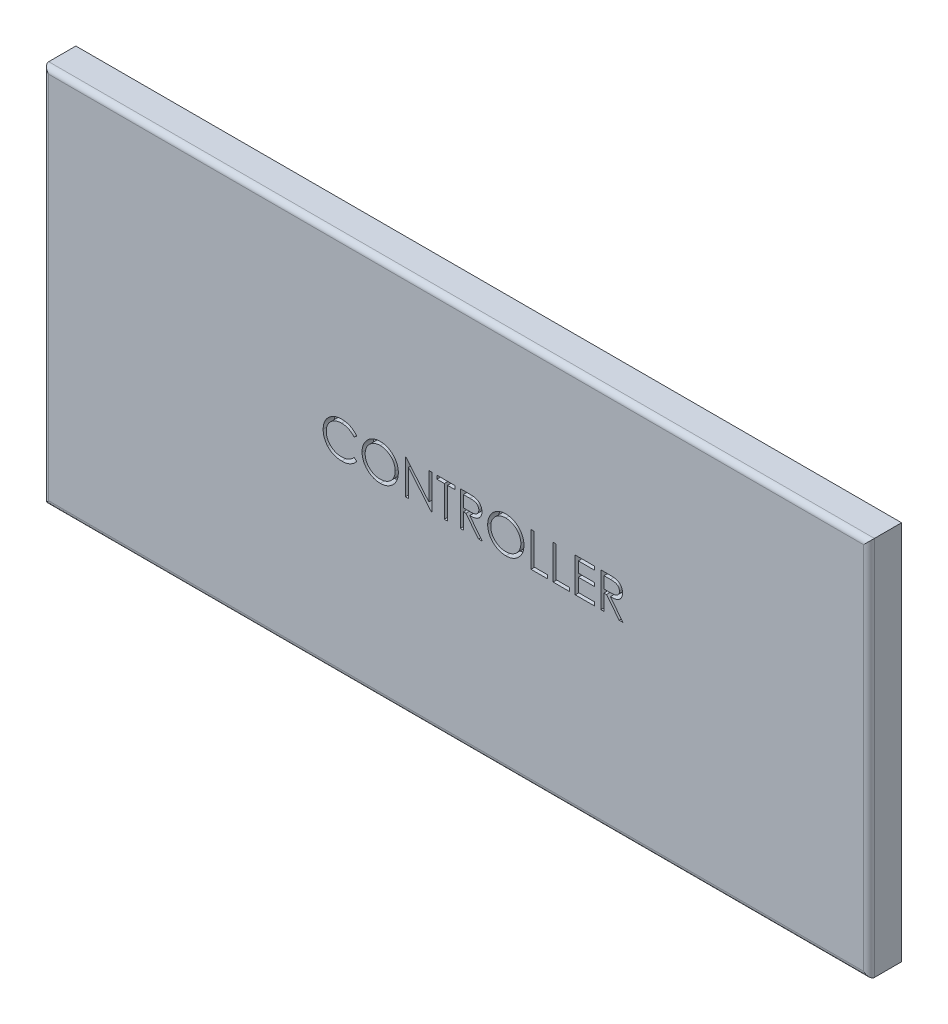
from build123d import *

# Parameters (mm, degrees)
SKETCH1_W           = 76
SKETCH1_H           = 35
BOSS_EXTRUDE1_DEPTH = 3
CUT_EXTRUDE1_DEPTH  = 1
FILLET1_R           = 0.5


with BuildPart() as part:
    # Sketch1 → Boss-Extrude1 (new body)
    with BuildSketch(Plane.XY):
        with Locations((-6.386554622, 2.138655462)):
            Rectangle(SKETCH1_W, SKETCH1_H)
    extrude(amount=BOSS_EXTRUDE1_DEPTH)

    # Sketch2 → Cut-Extrude1 (cut)
    # profile 1 of 10: a face of its own
    with BuildSketch(Plane.XY.offset(3)):
        with BuildLine():
            Line((-15.530587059, 4.464682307), (-15.77990597, 4.273877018))
            add(Edge.make_bspline(
                [(-15.77990597, 4.273877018), (-15.797691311, 4.295073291), (-15.833022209, 4.337180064), (-15.889863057, 4.396307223), (-15.949100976, 4.451702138), (-16.010713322, 4.503628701), (-16.075809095, 4.550271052), (-16.142811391, 4.594059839), (-16.212841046, 4.633309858), (-16.309680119, 4.680901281), (-16.436360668, 4.730563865), (-16.5958317, 4.772204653), (-16.762302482, 4.798712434), (-16.875874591, 4.801583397), (-16.933641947, 4.803043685)],
                knots=[0, 0, 0, 0, 0.757959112, 1.505699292, 2.245454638, 2.979532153, 3.711538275, 4.438200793, 5.171680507, 5.909471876, 7.393775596, 8.890124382, 10.418191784, 12, 12, 12, 12], degree=3))
            add(Edge.make_bspline(
                [(-16.933641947, 4.803043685), (-16.965467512, 4.802677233), (-17.028823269, 4.801947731), (-17.122847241, 4.792323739), (-17.215115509, 4.778797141), (-17.305568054, 4.758726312), (-17.394089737, 4.73335115), (-17.481259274, 4.703029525), (-17.565814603, 4.665514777), (-17.648925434, 4.624050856), (-17.728553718, 4.577217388), (-17.803896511, 4.526133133), (-17.874679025, 4.471369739), (-17.940957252, 4.412721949), (-18.002798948, 4.350453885), (-18.059756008, 4.283901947), (-18.111631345, 4.213278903), (-18.159453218, 4.139516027), (-18.202281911, 4.062828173), (-18.238141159, 3.982931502), (-18.269895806, 3.901194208), (-18.295022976, 3.816692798), (-18.314911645, 3.730021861), (-18.328634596, 3.640948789), (-18.338149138, 3.549659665), (-18.338875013, 3.487784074), (-18.339240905, 3.456594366)],
                knots=[0, 0, 0, 0, 1.054917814, 2.100044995, 3.131103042, 4.146048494, 5.169673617, 6.183595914, 7.203665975, 8.234915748, 9.262203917, 10.264457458, 11.251630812, 12.227803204, 13.197192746, 14.159520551, 15.12972552, 16.100847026, 17.073214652, 18.039054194, 19.002613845, 19.979014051, 20.95965708, 21.949030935, 22.966165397, 24, 24, 24, 24], degree=3))
            add(Edge.make_bspline(
                [(-18.339240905, 3.456594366), (-18.338096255, 3.409666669), (-18.335848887, 3.317530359), (-18.315847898, 3.182574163), (-18.285453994, 3.053287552), (-18.239901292, 2.930478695), (-18.183731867, 2.812633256), (-18.112756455, 2.701745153), (-18.030554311, 2.596138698), (-17.935962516, 2.498309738), (-17.832180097, 2.408943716), (-17.720830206, 2.330248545), (-17.602190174, 2.264648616), (-17.477569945, 2.210060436), (-17.346010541, 2.168098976), (-17.207748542, 2.138558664), (-17.063084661, 2.119288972), (-16.964233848, 2.117444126), (-16.913925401, 2.116505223)],
                knots=[0, 0, 0, 0, 1.029171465, 2.020641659, 2.987623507, 3.938342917, 4.889210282, 5.84687017, 6.821220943, 7.821438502, 8.827599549, 9.822697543, 10.807740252, 11.797342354, 12.80366471, 13.83203677, 14.896651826, 16, 16, 16, 16], degree=3))
            add(Edge.make_bspline(
                [(-16.913925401, 2.116505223), (-16.858496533, 2.118037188), (-16.749399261, 2.12105246), (-16.589408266, 2.146596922), (-16.436250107, 2.188015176), (-16.289916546, 2.24597972), (-16.150820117, 2.321331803), (-16.018743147, 2.412679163), (-15.893574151, 2.520890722), (-15.818307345, 2.603516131), (-15.77990597, 2.64567189)],
                knots=[0, 0, 0, 0, 1.028121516, 2.023589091, 2.998037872, 3.967518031, 4.937445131, 5.927275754, 6.942489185, 8, 8, 8, 8], degree=3))
            Line((-15.77990597, 2.64567189), (-15.530587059, 2.456774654))
            add(Edge.make_bspline(
                [(-15.530587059, 2.456774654), (-15.550651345, 2.430886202), (-15.590683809, 2.3792333), (-15.655506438, 2.306415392), (-15.723793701, 2.237922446), (-15.796052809, 2.174306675), (-15.87145252, 2.114295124), (-15.951346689, 2.059592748), (-16.034685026, 2.009436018), (-16.12118516, 1.963510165), (-16.210755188, 1.922763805), (-16.303287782, 1.887880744), (-16.39838409, 1.857831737), (-16.496048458, 1.833110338), (-16.596483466, 1.813814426), (-16.699326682, 1.800915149), (-16.804800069, 1.792077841), (-16.875957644, 1.791272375), (-16.912017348, 1.790864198)],
                knots=[0, 0, 0, 0, 0.986787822, 1.968848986, 2.935600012, 3.899624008, 4.868462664, 5.837806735, 6.815139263, 7.798259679, 8.787526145, 9.778297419, 10.776456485, 11.791383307, 12.812564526, 13.85620153, 14.913611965, 16, 16, 16, 16], degree=3))
            add(Edge.make_bspline(
                [(-16.912017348, 1.790864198), (-16.946165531, 1.791101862), (-17.013689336, 1.791571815), (-17.113383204, 1.79918471), (-17.210438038, 1.809571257), (-17.304576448, 1.825210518), (-17.396312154, 1.843665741), (-17.484813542, 1.868404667), (-17.570951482, 1.896117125), (-17.654379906, 1.928688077), (-17.735169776, 1.965442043), (-17.813060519, 2.006981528), (-17.888016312, 2.05295722), (-17.960774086, 2.102355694), (-18.030259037, 2.156763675), (-18.097073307, 2.21542555), (-18.161591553, 2.278143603), (-18.201508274, 2.323369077), (-18.221577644, 2.346107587)],
                knots=[0, 0, 0, 0, 1.114604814, 2.203992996, 3.262667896, 4.300477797, 5.318619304, 6.316056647, 7.298880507, 8.271930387, 9.238335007, 10.195173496, 11.151986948, 12.108099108, 13.064862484, 14.031167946, 15.010108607, 16, 16, 16, 16], degree=3))
            add(Edge.make_bspline(
                [(-18.221577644, 2.346107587), (-18.253722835, 2.385605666), (-18.317625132, 2.464124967), (-18.399382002, 2.591384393), (-18.469365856, 2.724251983), (-18.525949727, 2.863425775), (-18.570184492, 3.008593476), (-18.600828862, 3.159828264), (-18.620742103, 3.316988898), (-18.623019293, 3.423883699), (-18.624176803, 3.478218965)],
                knots=[0, 0, 0, 0, 0.994628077, 1.977248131, 2.950237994, 3.925870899, 4.908910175, 5.911660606, 6.938484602, 8, 8, 8, 8], degree=3))
            add(Edge.make_bspline(
                [(-18.624176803, 3.478218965), (-18.62276602, 3.535328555), (-18.619990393, 3.647688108), (-18.596408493, 3.812583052), (-18.558472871, 3.970563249), (-18.504591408, 4.121333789), (-18.436278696, 4.265687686), (-18.351890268, 4.402522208), (-18.252406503, 4.532712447), (-18.138607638, 4.654282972), (-18.013814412, 4.76544367), (-17.880175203, 4.863239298), (-17.737951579, 4.944625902), (-17.588710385, 5.012658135), (-17.431334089, 5.064949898), (-17.266158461, 5.101556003), (-17.093493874, 5.124340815), (-16.975690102, 5.127221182), (-16.915833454, 5.128684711)],
                knots=[0, 0, 0, 0, 1.032925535, 2.032216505, 3.007276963, 3.968222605, 4.92396291, 5.891752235, 6.871517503, 7.883894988, 8.900124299, 9.891468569, 10.874487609, 11.85992873, 12.854644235, 13.869047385, 14.917252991, 16, 16, 16, 16], degree=3))
            add(Edge.make_bspline(
                [(-16.915833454, 5.128684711), (-16.879353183, 5.128247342), (-16.80714416, 5.127381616), (-16.700325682, 5.118939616), (-16.596328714, 5.104866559), (-16.495081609, 5.085711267), (-16.396091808, 5.061937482), (-16.300115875, 5.030967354), (-16.206590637, 4.995555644), (-16.116105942, 4.954771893), (-16.029095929, 4.908991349), (-15.945587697, 4.858721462), (-15.866244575, 4.804024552), (-15.790508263, 4.745365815), (-15.7196457, 4.681504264), (-15.65164493, 4.614196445), (-15.588815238, 4.541503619), (-15.550031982, 4.490336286), (-15.530587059, 4.464682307)],
                knots=[0, 0, 0, 0, 1.096760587, 2.17092713, 3.219439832, 4.250915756, 5.268269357, 6.278326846, 7.281116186, 8.274029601, 9.260640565, 10.235837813, 11.203064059, 12.156899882, 13.114053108, 14.069676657, 15.032185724, 16, 16, 16, 16], degree=3))
        make_face()
    # profile 2 of 10: a face of its own
    with BuildSketch(Plane.XY.offset(3)):
        with BuildLine():
            add(Edge.make_bspline(
                [(-13.393567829, 5.128684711), (-13.334777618, 5.127195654), (-13.219308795, 5.124271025), (-13.049605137, 5.101883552), (-12.887593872, 5.063152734), (-12.731955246, 5.011569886), (-12.584550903, 4.942759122), (-12.444271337, 4.859587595), (-12.311450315, 4.76118395), (-12.187878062, 4.648308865), (-12.0747964, 4.525496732), (-11.975168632, 4.394434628), (-11.891673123, 4.255915), (-11.823106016, 4.110354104), (-11.769313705, 3.958081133), (-11.732194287, 3.798284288), (-11.708483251, 3.631998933), (-11.705711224, 3.518581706), (-11.704305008, 3.461046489)],
                knots=[0, 0, 0, 0, 1.065120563, 2.091984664, 3.0946048, 4.079830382, 5.057816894, 6.036188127, 7.030412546, 8.04752943, 9.064399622, 10.05169764, 11.02544977, 11.989514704, 12.962713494, 13.945757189, 14.957906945, 16, 16, 16, 16], degree=3))
            add(Edge.make_bspline(
                [(-11.704305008, 3.461046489), (-11.705711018, 3.403935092), (-11.708482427, 3.29136191), (-11.732221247, 3.126131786), (-11.769451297, 2.967299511), (-11.822606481, 2.81513024), (-11.890846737, 2.66946345), (-11.974898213, 2.530682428), (-12.073904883, 2.398741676), (-12.186578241, 2.275086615), (-12.309406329, 2.161696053), (-12.441150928, 2.062891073), (-12.578849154, 1.977869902), (-12.724272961, 1.910030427), (-12.875493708, 1.855808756), (-13.033864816, 1.818840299), (-13.19864419, 1.794994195), (-13.311012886, 1.79225597), (-13.368127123, 1.790864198)],
                knots=[0, 0, 0, 0, 1.043624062, 2.057103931, 3.04512605, 4.022047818, 4.998200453, 5.980619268, 6.982898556, 8.009068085, 9.034988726, 10.034168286, 11.015286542, 11.987931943, 12.962482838, 13.94673481, 14.956375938, 16, 16, 16, 16], degree=3))
            add(Edge.make_bspline(
                [(-13.368127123, 1.790864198), (-13.425662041, 1.792269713), (-13.53907868, 1.795040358), (-13.705572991, 1.818790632), (-13.865482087, 1.855930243), (-14.018348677, 1.90900666), (-14.164258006, 1.977602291), (-14.303495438, 2.061244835), (-14.435502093, 2.160492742), (-14.559183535, 2.273129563), (-14.672348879, 2.395749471), (-14.771009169, 2.527134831), (-14.854670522, 2.664707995), (-14.923035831, 2.808850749), (-14.977160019, 2.958866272), (-15.014085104, 3.115755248), (-15.037975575, 3.278623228), (-15.040728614, 3.389515), (-15.042125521, 3.445782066)],
                knots=[0, 0, 0, 0, 1.053102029, 2.075944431, 3.073151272, 4.055350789, 5.033113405, 6.020478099, 7.024410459, 8.052272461, 9.079885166, 10.07527673, 11.055994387, 12.023226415, 12.992069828, 13.970394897, 14.97016774, 16, 16, 16, 16], degree=3))
            add(Edge.make_bspline(
                [(-15.042125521, 3.445782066), (-15.04164053, 3.483548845), (-15.040676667, 3.558605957), (-15.029072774, 3.670063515), (-15.01223466, 3.779728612), (-14.988102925, 3.887289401), (-14.956541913, 3.99248258), (-14.919301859, 4.096033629), (-14.873817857, 4.19689315), (-14.822400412, 4.295538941), (-14.765012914, 4.390433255), (-14.701625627, 4.480131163), (-14.634464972, 4.565385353), (-14.560838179, 4.643986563), (-14.483171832, 4.71822138), (-14.400206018, 4.786948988), (-14.312446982, 4.850789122), (-14.219517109, 4.908320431), (-14.123706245, 4.960353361), (-14.024939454, 5.005004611), (-13.924558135, 5.043327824), (-13.822092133, 5.074389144), (-13.717813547, 5.098911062), (-13.611494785, 5.115609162), (-13.503220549, 5.12724265), (-13.430275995, 5.128201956), (-13.393567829, 5.128684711)],
                knots=[0, 0, 0, 0, 1.037015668, 2.060948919, 3.074880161, 4.083647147, 5.086022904, 6.090072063, 7.104153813, 8.122640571, 9.144368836, 10.147691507, 11.138137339, 12.123020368, 13.103399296, 14.087645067, 15.080126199, 16.082011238, 17.087798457, 18.072939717, 19.057185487, 20.037253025, 21.01195951, 21.997135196, 22.992090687, 24, 24, 24, 24], degree=3))
        make_face()
        with BuildLine():
            add(Edge.make_bspline(
                [(-13.379575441, 4.803043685), (-13.409705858, 4.802676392), (-13.469678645, 4.801945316), (-13.55883676, 4.792315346), (-13.6468223, 4.778590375), (-13.733653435, 4.759012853), (-13.818966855, 4.732339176), (-13.903557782, 4.701640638), (-13.986654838, 4.66424722), (-14.067983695, 4.621999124), (-14.146828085, 4.575236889), (-14.221225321, 4.523555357), (-14.291368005, 4.468166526), (-14.357084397, 4.408941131), (-14.418181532, 4.345577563), (-14.47586194, 4.279036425), (-14.527813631, 4.207415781), (-14.575425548, 4.132657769), (-14.618032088, 4.054859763), (-14.655919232, 3.974840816), (-14.686910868, 3.891948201), (-14.712186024, 3.807081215), (-14.733140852, 3.720374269), (-14.746415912, 3.631169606), (-14.756151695, 3.539915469), (-14.756840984, 3.478246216), (-14.757189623, 3.447054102)],
                knots=[0, 0, 0, 0, 1.008559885, 2.007477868, 2.99961109, 3.989939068, 4.984837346, 5.991145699, 7.001802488, 8.033829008, 9.059044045, 10.069351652, 11.065060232, 12.050310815, 13.029377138, 14.011219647, 14.996725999, 15.989392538, 16.977580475, 17.965360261, 18.951710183, 19.937753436, 20.929683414, 21.935841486, 22.955955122, 24, 24, 24, 24], degree=3))
            add(Edge.make_bspline(
                [(-14.757189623, 3.447054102), (-14.756033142, 3.401186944), (-14.753757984, 3.310952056), (-14.733839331, 3.178719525), (-14.703157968, 3.051639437), (-14.657930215, 2.930407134), (-14.6013693, 2.813980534), (-14.531494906, 2.703392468), (-14.448709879, 2.598613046), (-14.354672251, 2.500373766), (-14.251872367, 2.410706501), (-14.142713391, 2.331999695), (-14.028364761, 2.265406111), (-13.908528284, 2.211154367), (-13.783843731, 2.168165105), (-13.653507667, 2.138702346), (-13.518388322, 2.119311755), (-13.426285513, 2.117449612), (-13.379575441, 2.116505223)],
                knots=[0, 0, 0, 0, 1.032063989, 2.030389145, 3.003944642, 3.970395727, 4.937377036, 5.913328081, 6.909231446, 7.93887556, 8.970685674, 9.976071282, 10.964166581, 11.944589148, 12.933237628, 13.927779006, 14.949070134, 16, 16, 16, 16], degree=3))
            add(Edge.make_bspline(
                [(-13.379575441, 2.116505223), (-13.348179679, 2.116936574), (-13.285912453, 2.117792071), (-13.193297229, 2.126408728), (-13.102350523, 2.140226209), (-13.013199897, 2.160120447), (-12.925946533, 2.185018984), (-12.840226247, 2.214598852), (-12.756952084, 2.251502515), (-12.675073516, 2.292276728), (-12.596699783, 2.338758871), (-12.521882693, 2.388686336), (-12.452508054, 2.443993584), (-12.386840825, 2.502339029), (-12.32549285, 2.564899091), (-12.268878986, 2.631592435), (-12.217189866, 2.702840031), (-12.169596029, 2.777484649), (-12.127138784, 2.855495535), (-12.090146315, 2.9358046), (-12.058762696, 3.018214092), (-12.033427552, 3.102842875), (-12.013574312, 3.189530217), (-11.99989467, 3.278392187), (-11.99032573, 3.36925102), (-11.989604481, 3.430704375), (-11.989240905, 3.461682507)],
                knots=[0, 0, 0, 0, 1.047197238, 2.076906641, 3.100256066, 4.114471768, 5.12198147, 6.126382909, 7.136867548, 8.15857795, 9.17633901, 10.174870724, 11.156907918, 12.133735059, 13.104061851, 14.077631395, 15.04955518, 16.038496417, 17.029181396, 18.010275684, 18.986308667, 19.968651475, 20.955262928, 21.950658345, 22.966943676, 24, 24, 24, 24], degree=3))
            add(Edge.make_bspline(
                [(-11.989240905, 3.461682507), (-11.989604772, 3.492448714), (-11.990326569, 3.553479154), (-11.9998901, 3.643704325), (-12.013588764, 3.731926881), (-12.03333065, 3.817800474), (-12.058776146, 3.901346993), (-12.090151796, 3.982487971), (-12.127149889, 4.061525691), (-12.169611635, 4.138264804), (-12.217341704, 4.211901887), (-12.269497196, 4.282298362), (-12.326978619, 4.348132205), (-12.388143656, 4.411028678), (-12.454520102, 4.469646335), (-12.525807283, 4.524004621), (-12.601139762, 4.575415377), (-12.680902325, 4.621793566), (-12.763220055, 4.66462362), (-12.847687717, 4.701318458), (-12.9333484, 4.732498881), (-13.019984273, 4.759093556), (-13.108324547, 4.778513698), (-13.197772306, 4.792327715), (-13.288203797, 4.801941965), (-13.349021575, 4.802675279), (-13.379575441, 4.803043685)],
                knots=[0, 0, 0, 0, 1.02996197, 2.043119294, 3.035359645, 4.018872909, 4.991431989, 5.957985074, 6.929999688, 7.912076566, 8.892894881, 9.867085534, 10.843653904, 11.817741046, 12.803660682, 13.806313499, 14.818574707, 15.856120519, 16.894564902, 17.924820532, 18.937903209, 19.946497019, 20.957711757, 21.963978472, 22.977135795, 24, 24, 24, 24], degree=3))
        make_face(mode=Mode.SUBTRACT)
    # profile 3 of 10: a face of its own
    with BuildSketch(Plane.XY.offset(3)):
        Polygon((-11.053022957, 1.872274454), (-11.053022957, 5.047274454), (-10.9932373, 5.047274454), (-8.895651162, 2.548361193), (-8.895651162, 5.047274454), (-8.610715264, 5.047274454), (-8.610715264, 1.872274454), (-8.675589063, 1.872274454), (-10.768087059, 4.365463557), (-10.768087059, 1.872274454), align=None)
    # profile 4 of 10: a face of its own
    with BuildSketch(Plane.XY.offset(3)):
        Polygon((-8.162958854, 4.721633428), (-8.162958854, 5.047274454), (-6.494048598, 5.047274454), (-6.494048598, 4.721633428), (-7.186035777, 4.721633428), (-7.186035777, 1.872274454), (-7.470971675, 1.872274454), (-7.470971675, 4.721633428), align=None)
    # profile 5 of 10: a face of its own
    with BuildSketch(Plane.XY.offset(3)):
        with BuildLine():
            Line((-6.005587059, 5.047274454), (-5.370205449, 5.047274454))
            add(Edge.make_bspline(
                [(-5.370205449, 5.047274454), (-5.327804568, 5.047133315), (-5.24639018, 5.046862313), (-5.129755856, 5.045351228), (-5.023776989, 5.041020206), (-4.928508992, 5.037293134), (-4.843953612, 5.030496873), (-4.76985157, 5.024001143), (-4.706544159, 5.015497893), (-4.668221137, 5.007600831), (-4.650869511, 5.004025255)],
                knots=[0, 0, 0, 0, 1.410062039, 2.707475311, 3.878576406, 4.937260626, 5.877586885, 6.699081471, 7.410979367, 8, 8, 8, 8], degree=3))
            add(Edge.make_bspline(
                [(-4.650869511, 5.004025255), (-4.627640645, 4.998285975), (-4.581678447, 4.98692985), (-4.515502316, 4.962927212), (-4.452442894, 4.935150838), (-4.392762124, 4.902526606), (-4.336758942, 4.864812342), (-4.283855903, 4.822659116), (-4.233812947, 4.77629758), (-4.188653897, 4.724558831), (-4.146073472, 4.670278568), (-4.110160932, 4.611583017), (-4.07920334, 4.550204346), (-4.054555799, 4.485518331), (-4.034709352, 4.418152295), (-4.020715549, 4.34749603), (-4.0123234, 4.273871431), (-4.011469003, 4.223653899), (-4.011035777, 4.19819092)],
                knots=[0, 0, 0, 0, 1.027469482, 2.033020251, 3.019912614, 3.986113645, 4.951240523, 5.91722682, 6.890402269, 7.87763091, 8.8651537, 9.85103654, 10.82876324, 11.815024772, 12.821070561, 13.842952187, 14.906261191, 16, 16, 16, 16], degree=3))
            add(Edge.make_bspline(
                [(-4.011035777, 4.19819092), (-4.012368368, 4.155886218), (-4.014968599, 4.073338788), (-4.039212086, 3.953540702), (-4.078923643, 3.841790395), (-4.133645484, 3.738228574), (-4.203331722, 3.644873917), (-4.287083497, 3.562876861), (-4.38494753, 3.494260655), (-4.476051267, 3.446678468), (-4.55652772, 3.4162049), (-4.622779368, 3.394763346), (-4.695048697, 3.378197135), (-4.772643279, 3.363356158), (-4.855886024, 3.352151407), (-4.944577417, 3.343944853), (-5.038780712, 3.338815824), (-5.103495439, 3.338052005), (-5.136786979, 3.337659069)],
                knots=[0, 0, 0, 0, 1.260483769, 2.459530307, 3.627416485, 4.787058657, 5.939039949, 7.08810263, 8.267026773, 9.491475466, 10.141966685, 10.831826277, 11.566392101, 12.351337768, 13.187381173, 14.07005841, 15.007169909, 16, 16, 16, 16], degree=3))
            Line((-5.136786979, 3.337659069), (-3.970330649, 1.872274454))
            Line((-3.970330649, 1.872274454), (-4.322684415, 1.872274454))
            Line((-4.322684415, 1.872274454), (-5.489140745, 3.337659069))
            Line((-5.489140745, 3.337659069), (-5.720651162, 3.337659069))
            Line((-5.720651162, 3.337659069), (-5.720651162, 1.872274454))
            Line((-5.720651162, 1.872274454), (-6.005587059, 1.872274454))
            Line((-6.005587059, 1.872274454), (-6.005587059, 5.047274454))
        make_face()
        with BuildLine():
            Line((-5.720651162, 4.721633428), (-5.720651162, 3.663300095))
            Line((-5.720651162, 3.663300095), (-5.13933105, 3.658847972))
            add(Edge.make_bspline(
                [(-5.13933105, 3.658847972), (-5.1121893, 3.658835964), (-5.059580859, 3.65881269), (-4.98347097, 3.662435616), (-4.912604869, 3.666557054), (-4.847253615, 3.672861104), (-4.787388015, 3.68098554), (-4.73303799, 3.691148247), (-4.684114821, 3.702988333), (-4.627056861, 3.721314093), (-4.563342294, 3.750348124), (-4.494098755, 3.792589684), (-4.435132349, 3.845720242), (-4.385314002, 3.906474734), (-4.345282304, 3.973273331), (-4.317059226, 4.045315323), (-4.29915001, 4.120781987), (-4.297037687, 4.172650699), (-4.295971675, 4.198826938)],
                knots=[0, 0, 0, 0, 1.146690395, 2.22261258, 3.21895312, 4.145990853, 4.996080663, 5.770904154, 6.481378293, 7.121626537, 8.300444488, 9.431385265, 10.535395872, 11.636531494, 12.74115979, 13.810798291, 14.895190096, 16, 16, 16, 16], degree=3))
            add(Edge.make_bspline(
                [(-4.295971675, 4.198826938), (-4.29706217, 4.224359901), (-4.299223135, 4.274956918), (-4.316865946, 4.349030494), (-4.346701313, 4.418941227), (-4.386907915, 4.484404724), (-4.435892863, 4.543827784), (-4.493331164, 4.594670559), (-4.557652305, 4.636625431), (-4.61776975, 4.663435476), (-4.671503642, 4.679872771), (-4.718157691, 4.691439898), (-4.770873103, 4.700733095), (-4.829905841, 4.708178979), (-4.895003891, 4.714578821), (-4.966496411, 4.718889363), (-5.043909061, 4.72144194), (-5.097563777, 4.721568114), (-5.125338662, 4.721633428)],
                knots=[0, 0, 0, 0, 1.101028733, 2.181837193, 3.264309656, 4.369019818, 5.486613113, 6.575447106, 7.666700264, 8.788928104, 9.402425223, 10.0903467, 10.862060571, 11.710948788, 12.657782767, 13.684531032, 14.801375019, 16, 16, 16, 16], degree=3))
            Line((-5.125338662, 4.721633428), (-5.720651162, 4.721633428))
        make_face(mode=Mode.SUBTRACT)
    # profile 6 of 10: a face of its own
    with BuildSketch(Plane.XY.offset(3)):
        with BuildLine():
            add(Edge.make_bspline(
                [(-1.833311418, 5.128684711), (-1.774521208, 5.127195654), (-1.659052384, 5.124271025), (-1.489348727, 5.101883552), (-1.327337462, 5.063152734), (-1.171698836, 5.011569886), (-1.024294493, 4.942759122), (-0.884014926, 4.859587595), (-0.751193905, 4.76118395), (-0.627621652, 4.648308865), (-0.51453999, 4.525496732), (-0.414912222, 4.394434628), (-0.331416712, 4.255915), (-0.262849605, 4.110354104), (-0.209057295, 3.958081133), (-0.171937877, 3.798284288), (-0.148226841, 3.631998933), (-0.145454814, 3.518581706), (-0.144048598, 3.461046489)],
                knots=[0, 0, 0, 0, 1.065120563, 2.091984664, 3.0946048, 4.079830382, 5.057816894, 6.036188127, 7.030412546, 8.04752943, 9.064399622, 10.05169764, 11.02544977, 11.989514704, 12.962713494, 13.945757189, 14.957906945, 16, 16, 16, 16], degree=3))
            add(Edge.make_bspline(
                [(-0.144048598, 3.461046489), (-0.145454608, 3.403935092), (-0.148226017, 3.29136191), (-0.171964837, 3.126131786), (-0.209194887, 2.967299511), (-0.262350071, 2.81513024), (-0.330590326, 2.66946345), (-0.414641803, 2.530682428), (-0.513648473, 2.398741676), (-0.626321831, 2.275086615), (-0.749149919, 2.161696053), (-0.880894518, 2.062891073), (-1.018592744, 1.977869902), (-1.16401655, 1.910030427), (-1.315237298, 1.855808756), (-1.473608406, 1.818840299), (-1.63838778, 1.794994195), (-1.750756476, 1.79225597), (-1.807870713, 1.790864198)],
                knots=[0, 0, 0, 0, 1.043624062, 2.057103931, 3.04512605, 4.022047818, 4.998200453, 5.980619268, 6.982898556, 8.009068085, 9.034988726, 10.034168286, 11.015286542, 11.987931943, 12.962482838, 13.94673481, 14.956375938, 16, 16, 16, 16], degree=3))
            add(Edge.make_bspline(
                [(-1.807870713, 1.790864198), (-1.865405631, 1.792269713), (-1.97882227, 1.795040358), (-2.145316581, 1.818790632), (-2.305225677, 1.855930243), (-2.458092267, 1.90900666), (-2.604001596, 1.977602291), (-2.743239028, 2.061244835), (-2.875245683, 2.160492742), (-2.998927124, 2.273129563), (-3.112092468, 2.395749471), (-3.210752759, 2.527134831), (-3.294414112, 2.664707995), (-3.362779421, 2.808850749), (-3.416903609, 2.958866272), (-3.453828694, 3.115755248), (-3.477719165, 3.278623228), (-3.480472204, 3.389515), (-3.481869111, 3.445782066)],
                knots=[0, 0, 0, 0, 1.053102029, 2.075944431, 3.073151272, 4.055350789, 5.033113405, 6.020478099, 7.024410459, 8.052272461, 9.079885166, 10.07527673, 11.055994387, 12.023226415, 12.992069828, 13.970394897, 14.97016774, 16, 16, 16, 16], degree=3))
            add(Edge.make_bspline(
                [(-3.481869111, 3.445782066), (-3.48138412, 3.483548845), (-3.480420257, 3.558605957), (-3.468816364, 3.670063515), (-3.45197825, 3.779728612), (-3.427846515, 3.887289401), (-3.396285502, 3.99248258), (-3.359045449, 4.096033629), (-3.313561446, 4.19689315), (-3.262144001, 4.295538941), (-3.204756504, 4.390433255), (-3.141369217, 4.480131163), (-3.074208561, 4.565385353), (-3.000581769, 4.643986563), (-2.922915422, 4.71822138), (-2.839949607, 4.786948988), (-2.752190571, 4.850789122), (-2.659260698, 4.908320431), (-2.563449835, 4.960353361), (-2.464683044, 5.005004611), (-2.364301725, 5.043327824), (-2.261835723, 5.074389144), (-2.157557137, 5.098911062), (-2.051238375, 5.115609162), (-1.942964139, 5.12724265), (-1.870019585, 5.128201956), (-1.833311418, 5.128684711)],
                knots=[0, 0, 0, 0, 1.037015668, 2.060948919, 3.074880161, 4.083647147, 5.086022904, 6.090072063, 7.104153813, 8.122640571, 9.144368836, 10.147691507, 11.138137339, 12.123020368, 13.103399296, 14.087645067, 15.080126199, 16.082011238, 17.087798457, 18.072939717, 19.057185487, 20.037253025, 21.01195951, 21.997135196, 22.992090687, 24, 24, 24, 24], degree=3))
        make_face()
        with BuildLine():
            add(Edge.make_bspline(
                [(-1.81931903, 4.803043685), (-1.849449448, 4.802676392), (-1.909422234, 4.801945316), (-1.998580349, 4.792315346), (-2.086565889, 4.778590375), (-2.173397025, 4.759012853), (-2.258710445, 4.732339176), (-2.343301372, 4.701640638), (-2.426398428, 4.66424722), (-2.507727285, 4.621999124), (-2.586571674, 4.575236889), (-2.660968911, 4.523555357), (-2.731111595, 4.468166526), (-2.796827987, 4.408941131), (-2.857925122, 4.345577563), (-2.915605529, 4.279036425), (-2.967557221, 4.207415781), (-3.015169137, 4.132657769), (-3.057775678, 4.054859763), (-3.095662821, 3.974840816), (-3.126654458, 3.891948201), (-3.151929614, 3.807081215), (-3.172884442, 3.720374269), (-3.186159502, 3.631169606), (-3.195895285, 3.539915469), (-3.196584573, 3.478246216), (-3.196933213, 3.447054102)],
                knots=[0, 0, 0, 0, 1.008559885, 2.007477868, 2.99961109, 3.989939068, 4.984837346, 5.991145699, 7.001802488, 8.033829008, 9.059044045, 10.069351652, 11.065060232, 12.050310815, 13.029377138, 14.011219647, 14.996725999, 15.989392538, 16.977580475, 17.965360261, 18.951710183, 19.937753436, 20.929683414, 21.935841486, 22.955955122, 24, 24, 24, 24], degree=3))
            add(Edge.make_bspline(
                [(-3.196933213, 3.447054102), (-3.195776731, 3.401186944), (-3.193501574, 3.310952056), (-3.173582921, 3.178719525), (-3.142901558, 3.051639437), (-3.097673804, 2.930407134), (-3.04111289, 2.813980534), (-2.971238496, 2.703392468), (-2.888453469, 2.598613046), (-2.794415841, 2.500373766), (-2.691615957, 2.410706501), (-2.582456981, 2.331999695), (-2.468108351, 2.265406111), (-2.348271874, 2.211154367), (-2.223587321, 2.168165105), (-2.093251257, 2.138702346), (-1.958131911, 2.119311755), (-1.866029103, 2.117449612), (-1.81931903, 2.116505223)],
                knots=[0, 0, 0, 0, 1.032063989, 2.030389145, 3.003944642, 3.970395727, 4.937377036, 5.913328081, 6.909231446, 7.93887556, 8.970685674, 9.976071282, 10.964166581, 11.944589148, 12.933237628, 13.927779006, 14.949070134, 16, 16, 16, 16], degree=3))
            add(Edge.make_bspline(
                [(-1.81931903, 2.116505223), (-1.787923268, 2.116936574), (-1.725656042, 2.117792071), (-1.633040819, 2.126408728), (-1.542094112, 2.140226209), (-1.452943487, 2.160120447), (-1.365690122, 2.185018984), (-1.279969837, 2.214598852), (-1.196695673, 2.251502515), (-1.114817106, 2.292276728), (-1.036443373, 2.338758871), (-0.961626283, 2.388686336), (-0.892251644, 2.443993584), (-0.826584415, 2.502339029), (-0.76523644, 2.564899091), (-0.708622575, 2.631592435), (-0.656933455, 2.702840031), (-0.609339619, 2.777484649), (-0.566882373, 2.855495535), (-0.529889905, 2.9358046), (-0.498506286, 3.018214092), (-0.473171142, 3.102842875), (-0.453317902, 3.189530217), (-0.43963826, 3.278392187), (-0.430069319, 3.36925102), (-0.429348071, 3.430704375), (-0.428984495, 3.461682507)],
                knots=[0, 0, 0, 0, 1.047197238, 2.076906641, 3.100256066, 4.114471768, 5.12198147, 6.126382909, 7.136867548, 8.15857795, 9.17633901, 10.174870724, 11.156907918, 12.133735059, 13.104061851, 14.077631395, 15.04955518, 16.038496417, 17.029181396, 18.010275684, 18.986308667, 19.968651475, 20.955262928, 21.950658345, 22.966943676, 24, 24, 24, 24], degree=3))
            add(Edge.make_bspline(
                [(-0.428984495, 3.461682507), (-0.429348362, 3.492448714), (-0.430070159, 3.553479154), (-0.439633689, 3.643704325), (-0.453332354, 3.731926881), (-0.473074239, 3.817800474), (-0.498519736, 3.901346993), (-0.529895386, 3.982487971), (-0.566893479, 4.061525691), (-0.609355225, 4.138264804), (-0.657085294, 4.211901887), (-0.709240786, 4.282298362), (-0.766722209, 4.348132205), (-0.827887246, 4.411028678), (-0.894263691, 4.469646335), (-0.965550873, 4.524004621), (-1.040883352, 4.575415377), (-1.120645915, 4.621793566), (-1.202963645, 4.66462362), (-1.287431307, 4.701318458), (-1.37309199, 4.732498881), (-1.459727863, 4.759093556), (-1.548068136, 4.778513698), (-1.637515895, 4.792327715), (-1.727947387, 4.801941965), (-1.788765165, 4.802675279), (-1.81931903, 4.803043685)],
                knots=[0, 0, 0, 0, 1.02996197, 2.043119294, 3.035359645, 4.018872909, 4.991431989, 5.957985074, 6.929999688, 7.912076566, 8.892894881, 9.867085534, 10.843653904, 11.817741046, 12.803660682, 13.806313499, 14.818574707, 15.856120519, 16.894564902, 17.924820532, 18.937903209, 19.946497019, 20.957711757, 21.963978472, 22.977135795, 24, 24, 24, 24], degree=3))
        make_face(mode=Mode.SUBTRACT)
    # profile 7 of 10: a face of its own
    with BuildSketch(Plane.XY.offset(3)):
        Polygon((0.507233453, 5.047274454), (0.792169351, 5.047274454), (0.792169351, 2.19791548), (2.013323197, 2.19791548), (2.013323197, 1.872274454), (0.507233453, 1.872274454), align=None)
    # profile 8 of 10: a face of its own
    with BuildSketch(Plane.XY.offset(3)):
        Polygon((2.542489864, 5.047274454), (2.827425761, 5.047274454), (2.827425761, 2.19791548), (4.048579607, 2.19791548), (4.048579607, 1.872274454), (2.542489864, 1.872274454), align=None)
    # profile 9 of 10: a face of its own
    with BuildSketch(Plane.XY.offset(3)):
        Polygon((4.577746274, 5.047274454), (6.368771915, 5.047274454), (6.368771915, 4.721633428), (4.862682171, 4.721633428), (4.862682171, 3.744710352), (6.368771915, 3.744710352), (6.368771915, 3.419069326), (4.862682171, 3.419069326), (4.862682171, 2.19791548), (6.368771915, 2.19791548), (6.368771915, 1.872274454), (4.577746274, 1.872274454), align=None)
    # profile 10 of 10: a face of its own
    with BuildSketch(Plane.XY.offset(3)):
        with BuildLine():
            Line((6.93864371, 5.047274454), (7.57402532, 5.047274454))
            add(Edge.make_bspline(
                [(7.57402532, 5.047274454), (7.616426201, 5.047133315), (7.697840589, 5.046862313), (7.814474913, 5.045351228), (7.92045378, 5.041020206), (8.015721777, 5.037293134), (8.100277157, 5.030496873), (8.174379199, 5.024001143), (8.23768661, 5.015497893), (8.276009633, 5.007600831), (8.293361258, 5.004025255)],
                knots=[0, 0, 0, 0, 1.410062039, 2.707475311, 3.878576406, 4.937260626, 5.877586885, 6.699081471, 7.410979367, 8, 8, 8, 8], degree=3))
            add(Edge.make_bspline(
                [(8.293361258, 5.004025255), (8.316590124, 4.998285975), (8.362552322, 4.98692985), (8.428728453, 4.962927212), (8.491787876, 4.935150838), (8.551468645, 4.902526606), (8.607471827, 4.864812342), (8.660374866, 4.822659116), (8.710417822, 4.77629758), (8.755576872, 4.724558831), (8.798157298, 4.670278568), (8.834069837, 4.611583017), (8.86502743, 4.550204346), (8.88967497, 4.485518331), (8.909521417, 4.418152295), (8.92351522, 4.34749603), (8.931907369, 4.273871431), (8.932761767, 4.223653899), (8.933194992, 4.19819092)],
                knots=[0, 0, 0, 0, 1.027469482, 2.033020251, 3.019912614, 3.986113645, 4.951240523, 5.91722682, 6.890402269, 7.87763091, 8.8651537, 9.85103654, 10.82876324, 11.815024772, 12.821070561, 13.842952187, 14.906261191, 16, 16, 16, 16], degree=3))
            add(Edge.make_bspline(
                [(8.933194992, 4.19819092), (8.931862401, 4.155886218), (8.92926217, 4.073338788), (8.905018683, 3.953540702), (8.865307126, 3.841790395), (8.810585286, 3.738228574), (8.740899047, 3.644873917), (8.657147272, 3.562876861), (8.559283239, 3.494260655), (8.468179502, 3.446678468), (8.38770305, 3.4162049), (8.321451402, 3.394763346), (8.249182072, 3.378197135), (8.17158749, 3.363356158), (8.088344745, 3.352151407), (7.999653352, 3.343944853), (7.905450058, 3.338815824), (7.84073533, 3.338052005), (7.80744379, 3.337659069)],
                knots=[0, 0, 0, 0, 1.260483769, 2.459530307, 3.627416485, 4.787058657, 5.939039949, 7.08810263, 8.267026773, 9.491475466, 10.141966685, 10.831826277, 11.566392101, 12.351337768, 13.187381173, 14.07005841, 15.007169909, 16, 16, 16, 16], degree=3))
            Line((7.80744379, 3.337659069), (8.97390012, 1.872274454))
            Line((8.97390012, 1.872274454), (8.621546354, 1.872274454))
            Line((8.621546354, 1.872274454), (7.455090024, 3.337659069))
            Line((7.455090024, 3.337659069), (7.223579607, 3.337659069))
            Line((7.223579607, 3.337659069), (7.223579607, 1.872274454))
            Line((7.223579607, 1.872274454), (6.93864371, 1.872274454))
            Line((6.93864371, 1.872274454), (6.93864371, 5.047274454))
        make_face()
        with BuildLine():
            Line((7.223579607, 4.721633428), (7.223579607, 3.663300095))
            Line((7.223579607, 3.663300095), (7.80489972, 3.658847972))
            add(Edge.make_bspline(
                [(7.80489972, 3.658847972), (7.832041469, 3.658835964), (7.88464991, 3.65881269), (7.960759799, 3.662435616), (8.0316259, 3.666557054), (8.096977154, 3.672861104), (8.156842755, 3.68098554), (8.211192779, 3.691148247), (8.260115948, 3.702988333), (8.317173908, 3.721314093), (8.380888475, 3.750348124), (8.450132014, 3.792589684), (8.50909842, 3.845720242), (8.558916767, 3.906474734), (8.598948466, 3.973273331), (8.627171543, 4.045315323), (8.645080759, 4.120781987), (8.647193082, 4.172650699), (8.648259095, 4.198826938)],
                knots=[0, 0, 0, 0, 1.146690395, 2.22261258, 3.21895312, 4.145990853, 4.996080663, 5.770904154, 6.481378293, 7.121626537, 8.300444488, 9.431385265, 10.535395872, 11.636531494, 12.74115979, 13.810798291, 14.895190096, 16, 16, 16, 16], degree=3))
            add(Edge.make_bspline(
                [(8.648259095, 4.198826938), (8.647168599, 4.224359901), (8.645007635, 4.274956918), (8.627364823, 4.349030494), (8.597529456, 4.418941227), (8.557322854, 4.484404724), (8.508337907, 4.543827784), (8.450899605, 4.594670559), (8.386578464, 4.636625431), (8.32646102, 4.663435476), (8.272727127, 4.679872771), (8.226073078, 4.691439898), (8.173357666, 4.700733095), (8.114324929, 4.708178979), (8.049226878, 4.714578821), (7.977734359, 4.718889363), (7.900321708, 4.72144194), (7.846666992, 4.721568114), (7.818892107, 4.721633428)],
                knots=[0, 0, 0, 0, 1.101028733, 2.181837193, 3.264309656, 4.369019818, 5.486613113, 6.575447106, 7.666700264, 8.788928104, 9.402425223, 10.0903467, 10.862060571, 11.710948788, 12.657782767, 13.684531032, 14.801375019, 16, 16, 16, 16], degree=3))
            Line((7.818892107, 4.721633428), (7.223579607, 4.721633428))
        make_face(mode=Mode.SUBTRACT)
    extrude(amount=-CUT_EXTRUDE1_DEPTH, mode=Mode.SUBTRACT)

    # Fillet1
    fillet1_edges = [part.edges().sort_by_distance(p)[0] for p in [
        (31.613445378, 2.138655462, 3),
        (-6.386554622, 19.638655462, 3),
        (-44.386554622, 2.138655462, 3),
        (-6.386554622, -15.361344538, 3),
    ]]
    fillet(fillet1_edges, radius=FILLET1_R)


solid = part.part
